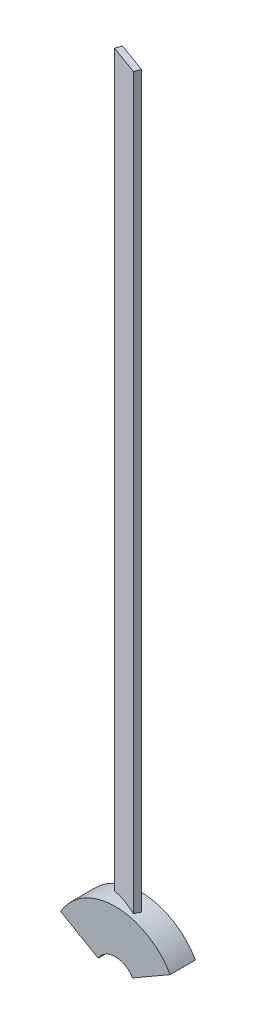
from build123d import *

# Parameters (mm, degrees)
SKETCH1_R               = 400
EXTRUDE1_DEPTH          = 80
EXTRUDE2_DEPTH          = 5000
CIRPATTERN1_COUNT       = 3
SKETCH3_R               = 125
CUT_EXTRUDE1_DEPTH      = 6650.410447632
CUT_EXTRUDE2_DEPTH      = 6650.410447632
CUT_EXTRUDE2_DEPTH_BACK = 6650.410447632


with BuildPart() as part:
    # Sketch1 → Extrude1 (new, symmetric)
    with BuildSketch(Plane.XY):
        Circle(SKETCH1_R)
    extrude(amount=EXTRUDE1_DEPTH, both=True)

    # Sketch2 → Extrude2 (add)
    with BuildSketch(Plane(origin=(0, 0, 0), x_dir=(1, 0, 0), z_dir=(0, 1, 0))):
        Polygon((-100.809664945, 15.408161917), (87.128859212, -52.995866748), (100.809664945, -15.408161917), (-87.128859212, 52.995866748), align=None)
    extrude2 = extrude(amount=EXTRUDE2_DEPTH)

    # CirPattern1: Extrude2 ×3 about axis
    cirpattern1_axis = Axis((0, 0, 0), (0, 0, 1))
    for i in range(1, CIRPATTERN1_COUNT):
        add(extrude2.rotate(cirpattern1_axis, i * 360 / CIRPATTERN1_COUNT))

    # Sketch3 → Cut-Extrude1 (cut, through all)
    with BuildSketch(Plane.XY.offset(80)):
        Circle(SKETCH3_R)
    extrude(amount=-CUT_EXTRUDE1_DEPTH, mode=Mode.SUBTRACT)

    # Sketch4 → Cut-Extrude2 (cut, two sides: drawn at the far end of the back side and taken through both)
    with BuildSketch(Plane.XY.offset(80).offset(-CUT_EXTRUDE2_DEPTH_BACK)):
        with BuildLine():
            Line((346.410161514, 200), (108.253175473, 62.5))
            ThreePointArc((108.253175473, 62.5), (120.740728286, 32.352380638), (125, 0))
            ThreePointArc((125, 0), (-32.352380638, -120.740728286), (-108.253175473, 62.5))
            Line((-108.253175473, 62.5), (-346.410161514, 200))
            ThreePointArc((-346.410161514, 200), (-103.527618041, -386.370330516), (400, 0))
            ThreePointArc((400, 0), (386.370330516, 103.527618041), (346.410161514, 200))
        make_face()
    extrude(amount=CUT_EXTRUDE2_DEPTH + CUT_EXTRUDE2_DEPTH_BACK, mode=Mode.SUBTRACT)


with BuildPart() as cut_extrude2_kept_piece:
    # of the separate pieces the step leaves, the one the design keeps (cut_extrude2_pieces_kept)
    add(part.part.solids().sort_by_distance((346.410161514, 200, 80))[0])


solid = cut_extrude2_kept_piece.part
